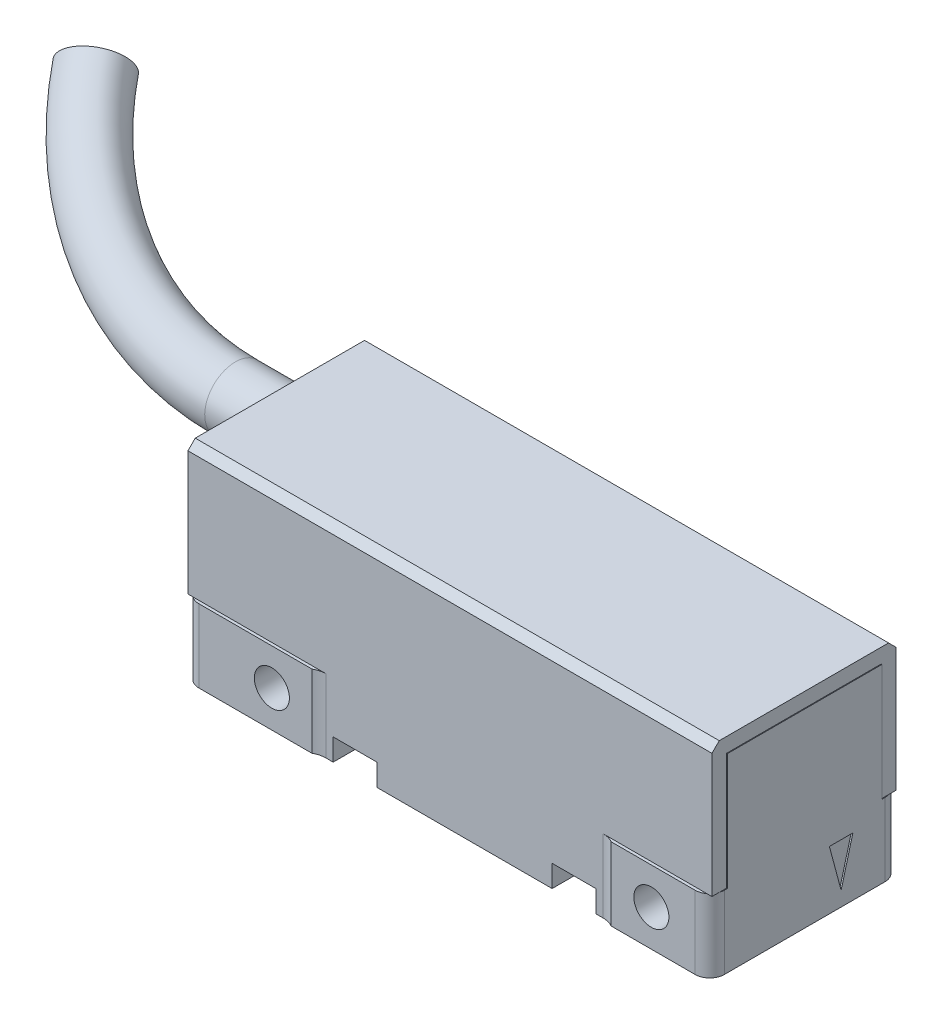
from build123d import *

# Parameters (mm, degrees)
SKETCH1_W          = 36
SKETCH1_H          = 14
SKETCH1_R          = 1.2
EXTRUDE1_DEPTH     = 13
EXTRUDE15_DEPTH    = 22
SKETCH2_OUTSIDE_W  = 46.152
SKETCH2_OUTSIDE_H  = 24.152
EXTRUDE2_DEPTH     = 0.2
SKETCH3_OUTSIDE_W  = 46.152
SKETCH3_OUTSIDE_H  = 24.152
EXTRUDE3_DEPTH     = 0.2
EXTRUDE14_DEPTH    = 15
SKETCH26_R         = 2.1
EXTRUDE22_DEPTH    = 5
SKETCH27_R         = 1.5
EXTRUDE23_DEPTH    = 0.05
SKETCH28_R         = 2.1
REVOLVE1_ANGLE     = 60
DOME1_FACE_RADIUS  = 1.5
DOME1_HEIGHT       = 1.4
EXTRUDE24_DEPTH    = 0.1
EXTRUDE25_DEPTH    = 0.1
EXTRUDE26_DEPTH    = 0.1
CHAMFER1_SIZE      = 0.5
SKETCH32_OUTSIDE_W = 76.781
SKETCH32_OUTSIDE_H = 34.333
EXTRUDE27_DEPTH    = 5
EXTRUDE28_DEPTH    = 0.05
EXTRUDE29_DEPTH    = 0.05


with BuildPart() as part:
    # Sketch1 → Extrude1 (new body)
    with BuildSketch(Plane(origin=(0, 0, 0), x_dir=(-1, 0, 0), z_dir=(0, 0, 1))):
        with Locations((-18, -7)):
            Rectangle(SKETCH1_W, SKETCH1_H)
        with Locations(Location((-6, -2.5, 0), (0, 0, 180))):
            Circle(SKETCH1_R, mode=Mode.SUBTRACT)
        with Locations(Location((-32, -2.5, 0), (0, 0, 180))):
            Circle(SKETCH1_R, mode=Mode.SUBTRACT)
    extrude(amount=EXTRUDE1_DEPTH)

    # Sketch19 → Extrude15 (cut)
    with BuildSketch(Plane(origin=(0, 14, 0), x_dir=(1, 0, 0), z_dir=(0, 1, 0))):
        with BuildLine():
            Line((8, 3.085190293), (30, 3.085190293))
            Line((30, 3.085190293), (30, 1.3))
            ThreePointArc((30, 1.3), (29.560660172, 0.239339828), (28.5, -0.2))
            Line((28.5, -0.2), (9.5, -0.2))
            ThreePointArc((9.5, -0.2), (8.439339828, 0.239339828), (8, 1.3))
            Line((8, 1.3), (8, 3.085190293))
        make_face()
        with BuildLine():
            Line((8, -15.335510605), (30, -15.335510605))
            Line((30, -15.335510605), (30, -14.3))
            ThreePointArc((30, -14.3), (29.560660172, -13.239339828), (28.5, -12.8))
            Line((28.5, -12.8), (9.5, -12.8))
            ThreePointArc((9.5, -12.8), (8.439339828, -13.239339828), (8, -14.3))
            Line((8, -14.3), (8, -15.335510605))
        make_face()
    extrude(amount=-EXTRUDE15_DEPTH, mode=Mode.SUBTRACT)

    # Sketch2 outside → Extrude2 (cut)
    with BuildSketch(Plane.XY.offset(13)):
        with Locations((18, 7)):
            Rectangle(SKETCH2_OUTSIDE_W, SKETCH2_OUTSIDE_H)
        Polygon((0, 0), (29, 0), (36, 0), (36, 5), (0, 5), align=None, mode=Mode.SUBTRACT)
    extrude(amount=-EXTRUDE2_DEPTH, mode=Mode.SUBTRACT)

    # Sketch3 outside → Extrude3 (cut)
    with BuildSketch(Plane(origin=(0, 0, 0), x_dir=(-1, 0, 0), z_dir=(0, 0, -1))):
        with Locations((-18, 7)):
            Rectangle(SKETCH3_OUTSIDE_W, SKETCH3_OUTSIDE_H)
        Polygon((-36, 0), (-9, 0), (0, 0), (0, 5), (-9, 5), (-36, 5), align=None, mode=Mode.SUBTRACT)
    extrude(amount=-EXTRUDE3_DEPTH, mode=Mode.SUBTRACT)

    # Sketch18 → Extrude14 (cut)
    with BuildSketch(Plane.XY.offset(13)):
        Polygon((10, 1.5), (13, 1.5), (13, -4.382762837), (25, -4.382762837), (25, 1.5), (28, 1.5), (28, -7.487938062), (10, -7.487938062), align=None)
    extrude(amount=-EXTRUDE14_DEPTH, mode=Mode.SUBTRACT)

    # Sketch26 → Extrude22 (add)
    with BuildSketch(Plane.ZY):
        with Locations(Location((4.5, 10, 0), (0, 0, 90))):
            Circle(SKETCH26_R)
    extrude(amount=EXTRUDE22_DEPTH)

    # Sketch27 → Extrude23 (add)
    with BuildSketch(Plane.ZY):
        with Locations(Location((9, 8, 0), (0, 0, 90))):
            Circle(SKETCH27_R)
    extrude(amount=EXTRUDE23_DEPTH)

    # Sketch28 → Revolve1 (revolve)
    with BuildSketch(Plane.ZY.offset(5)):
        with Locations(Location((4.5, 10, 0), (0, 0, 90))):
            Circle(SKETCH28_R)
    revolve(axis=Axis((-5, 24.527121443, -11.737052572), (0, -0.8424795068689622, -0.5387283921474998)), revolution_arc=REVOLVE1_ANGLE)

    # Dome1: a dome of height H over a round flat face of radius A is a cap of a sphere of radius (A * A + H * H) / (2 * H)
    dome1_r = (DOME1_FACE_RADIUS * DOME1_FACE_RADIUS + DOME1_HEIGHT * DOME1_HEIGHT) / (2 * DOME1_HEIGHT)
    dome1_base = Plane((-0.05, 8, 9), z_dir=(-1, 0, 0))
    with Locations(dome1_base.offset(DOME1_HEIGHT - dome1_r)):
        dome1_ball = Sphere(dome1_r, mode=Mode.PRIVATE)
    add(split(dome1_ball, bisect_by=dome1_base, keep=Keep.TOP, mode=Mode.PRIVATE))

    # Sketch29 → Extrude24 (cut)
    with BuildSketch(Plane.ZY):
        Polygon((3.196152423, 4), (4, 1), (4.803847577, 4), align=None)
    extrude(amount=-EXTRUDE24_DEPTH, mode=Mode.SUBTRACT)

    # Sketch30 → Extrude25 (cut)
    with BuildSketch(Plane(origin=(36, 0, 0), x_dir=(0, 0, -1), z_dir=(1, 0, 0))):
        Polygon((-4.803847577, 4), (-4, 1), (-3.196152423, 4), align=None)
    extrude(amount=-EXTRUDE25_DEPTH, mode=Mode.SUBTRACT)

    # Sketch31 → Extrude26 (cut)
    with BuildSketch(Plane(origin=(0, 0, 0.2), x_dir=(-1, 0, 0), z_dir=(0, 0, -1))):
        Polygon((-19.803847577, 4), (-19, 1), (-18.196152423, 4), align=None)
    extrude(amount=-EXTRUDE26_DEPTH, mode=Mode.SUBTRACT)

    # Chamfer1
    chamfer1_edges = [part.edges().sort_by_distance(p)[0] for p in [
        (18, 14, 0.2),
        (18, 14, 12.8),
    ]]
    chamfer(chamfer1_edges, length=CHAMFER1_SIZE)

    # Sketch32 outside → Extrude27 (cut)
    with BuildSketch(Plane.XZ):
        with Locations((5.2785, 3.5025)):
            Rectangle(SKETCH32_OUTSIDE_W, SKETCH32_OUTSIDE_H)
        with BuildLine():
            Line((1, 13), (35, 13))
            ThreePointArc((35, 13), (35.707106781, 12.707106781), (36, 12))
            Line((36, 12), (36, 1))
            ThreePointArc((36, 1), (35.707106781, 0.292893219), (35, 0))
            Line((35, 0), (1, 0))
            ThreePointArc((1, 0), (0.292893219, 0.292893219), (0, 1))
            Line((0, 1), (0, 12))
            ThreePointArc((0, 12), (0.292893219, 12.707106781), (1, 13))
        make_face(mode=Mode.SUBTRACT)
    extrude(amount=-EXTRUDE27_DEPTH, mode=Mode.SUBTRACT)

    # Sketch33 → Extrude28 (cut)
    with BuildSketch(Plane.ZY):
        Polygon((0.2, 5), (0.2, 13.5), (0.7, 14), (12.3, 14), (12.8, 13.5), (12.8, 5), (11.8, 5), (11.8, 13), (1.2, 13), (1.2, 5), align=None)
    extrude(amount=-EXTRUDE28_DEPTH, mode=Mode.SUBTRACT)

    # Sketch34 → Extrude29 (cut)
    with BuildSketch(Plane(origin=(36, 0, 0), x_dir=(0, 0, -1), z_dir=(1, 0, 0))):
        Polygon((-11.8, 13), (-11.8, 5), (-12.8, 5), (-12.8, 13.523976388), (-11.957050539, 14.366925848), (-0.989306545, 14.366925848), (-0.122380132, 13.499999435), (-0.122380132, 5), (-1.2, 5), (-1.2, 13), align=None)
    extrude(amount=-EXTRUDE29_DEPTH, mode=Mode.SUBTRACT)


solid = part.part
